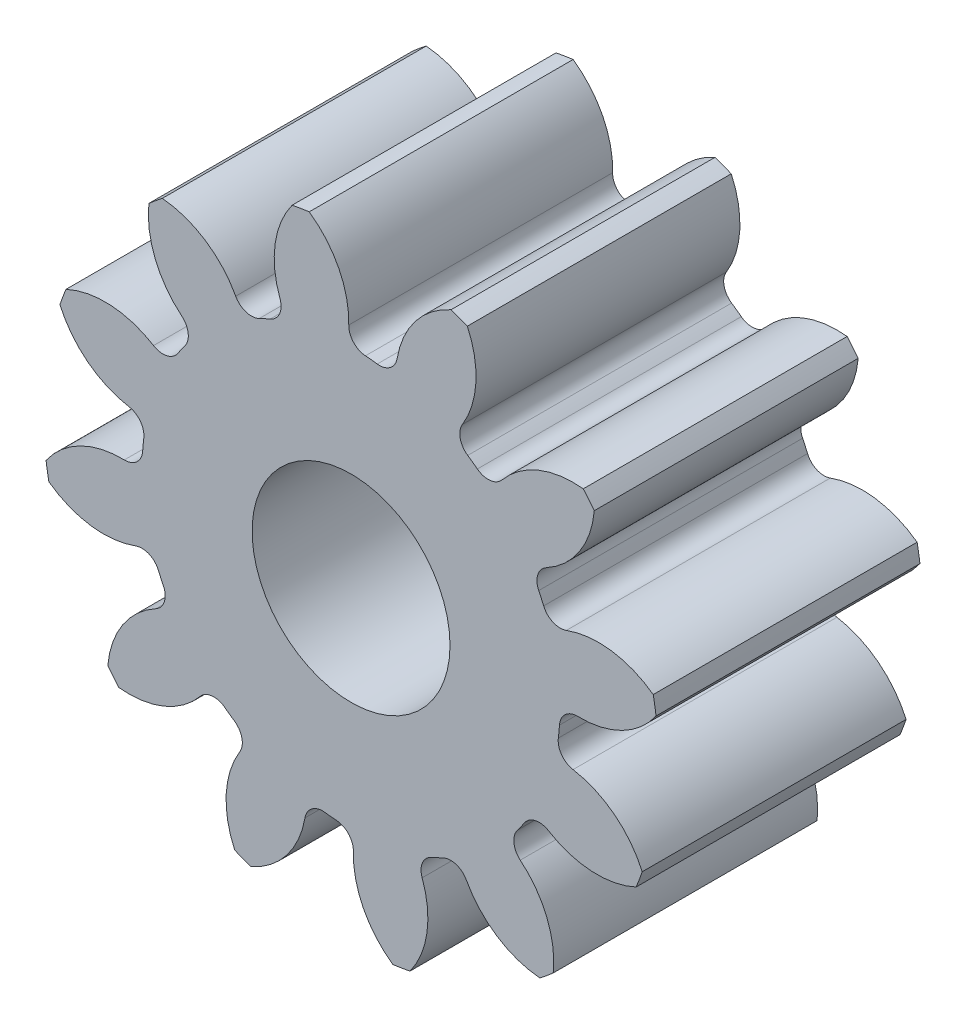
from build123d import *

# Parameters (mm, degrees)
SKETCH3_R         = 118.533333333
GEARBODY_DEPTH    = 101.6
TOOTHCUT_DEPTH    = 197.017504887
CIRPATTERN1_COUNT = 12
BOREDIA_R         = 38.1
BORE_DEPTH        = 12700


with BuildPart() as part:
    # Sketch3 → gearBody (new body)
    with BuildSketch(Plane.XY):
        Circle(SKETCH3_R)
    extrude(amount=GEARBODY_DEPTH)

    # Sketch2 → toothCut (cut, through all)
    with BuildSketch(Plane.XY):
        with BuildLine():
            ThreePointArc((79.797996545, -10.089641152), (80.052909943, -7.813624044), (80.242919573, -5.531271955))
            ThreePointArc((80.242919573, -5.531271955), (82.480459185, -0.90750195), (87.294491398, 0.884403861))
            ThreePointArc((87.294491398, 0.884403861), (105.165381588, 5.163694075), (118.533333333, 17.77237787))
            ThreePointArc((118.533333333, 17.77237787), (119.291394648, -11.64352564), (112.859508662, -40.357648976))
            ThreePointArc((112.859508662, -40.357648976), (102.181995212, -25.401989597), (85.475882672, -17.747785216))
            ThreePointArc((85.475882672, -17.747785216), (81.099209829, -15.058813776), (79.797996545, -10.089641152))
        make_face()
    toothcut = extrude(amount=TOOTHCUT_DEPTH, mode=Mode.SUBTRACT)

    # CirPattern1: toothCut ×12 about axis
    cirpattern1_axis = Axis((0, 0, 0), (0, 0, 1))
    for i in range(1, CIRPATTERN1_COUNT):
        add(toothcut.rotate(cirpattern1_axis, i * 360 / CIRPATTERN1_COUNT), mode=Mode.SUBTRACT)

    # boreDia → bore (cut, symmetric)
    with BuildSketch(Plane.XY):
        Circle(BOREDIA_R)
    extrude(amount=BORE_DEPTH, both=True, mode=Mode.SUBTRACT)


solid = part.part
